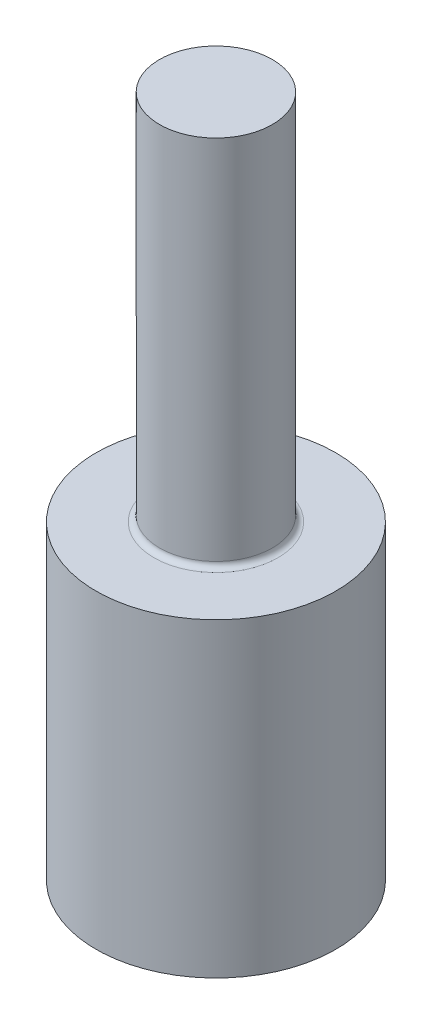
ISO-10303-21;
HEADER;
FILE_DESCRIPTION(('STEP AP214'),'2;1');
FILE_NAME('part.step','',(''),(''),'','','');
FILE_SCHEMA(('AUTOMOTIVE_DESIGN { 1 0 10303 214 1 1 1 1 }'));
ENDSEC;
DATA;
#1=APPLICATION_CONTEXT('core data for automotive mechanical design processes');
#2=APPLICATION_PROTOCOL_DEFINITION('international standard','automotive_design',2000,#1);
#3=PRODUCT_CONTEXT('',#1,'mechanical');
#4=PRODUCT('Part','Part','',(#3));
#5=PRODUCT_RELATED_PRODUCT_CATEGORY('part','',(#4));
#6=PRODUCT_DEFINITION_FORMATION('','',#4);
#7=PRODUCT_DEFINITION_CONTEXT('part definition',#1,'design');
#8=PRODUCT_DEFINITION('design','',#6,#7);
#9=PRODUCT_DEFINITION_SHAPE('','',#8);
#10=(LENGTH_UNIT() NAMED_UNIT(*) SI_UNIT(.MILLI.,.METRE.));
#11=(NAMED_UNIT(*) PLANE_ANGLE_UNIT() SI_UNIT($,.RADIAN.));
#12=(NAMED_UNIT(*) SI_UNIT($,.STERADIAN.) SOLID_ANGLE_UNIT());
#13=UNCERTAINTY_MEASURE_WITH_UNIT(LENGTH_MEASURE(1.E-05),#10,'distance_accuracy_value','');
#14=(GEOMETRIC_REPRESENTATION_CONTEXT(3) GLOBAL_UNCERTAINTY_ASSIGNED_CONTEXT((#13)) GLOBAL_UNIT_ASSIGNED_CONTEXT((#10,
#11,#12)) REPRESENTATION_CONTEXT('',''));
#15=CARTESIAN_POINT('',(0.,0.,0.));
#16=DIRECTION('',(0.,0.,1.));
#17=DIRECTION('',(1.,0.,0.));
#18=AXIS2_PLACEMENT_3D('',#15,#16,#17);
#19=CARTESIAN_POINT('',(0.,-6.000425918,0.));
#20=DIRECTION('',(0.,-1.,0.));
#21=DIRECTION('',(0.,0.,-1.));
#22=AXIS2_PLACEMENT_3D('',#19,#20,#21);
#23=CYLINDRICAL_SURFACE('',#22,2.);
#24=CARTESIAN_POINT('',(0.,5.199574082,0.));
#25=DIRECTION('',(0.,1.,0.));
#26=DIRECTION('',(0.,0.,1.));
#27=AXIS2_PLACEMENT_3D('',#24,#25,#26);
#28=CIRCLE('',#27,2.);
#29=CARTESIAN_POINT('',(0.,5.199574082,2.));
#30=VERTEX_POINT('',#29);
#31=EDGE_CURVE('E10',#30,#30,#28,.T.);
#32=ORIENTED_EDGE('',*,*,#31,.T.);
#33=EDGE_LOOP('',(#32));
#34=FACE_BOUND('',#33,.T.);
#35=CARTESIAN_POINT('',(0.,18.199574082,0.));
#36=DIRECTION('',(0.,-1.,0.));
#37=DIRECTION('',(0.,0.,-1.));
#38=AXIS2_PLACEMENT_3D('',#35,#36,#37);
#39=CIRCLE('',#38,2.);
#40=CARTESIAN_POINT('',(0.,18.199574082,-2.));
#41=VERTEX_POINT('',#40);
#42=EDGE_CURVE('E25',#41,#41,#39,.T.);
#43=ORIENTED_EDGE('',*,*,#42,.T.);
#44=EDGE_LOOP('',(#43));
#45=FACE_BOUND('',#44,.T.);
#46=ADVANCED_FACE('F14',(#34,#45),#23,.T.);
#47=CARTESIAN_POINT('',(4.25,4.999574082,0.));
#48=DIRECTION('',(0.,1.,0.));
#49=DIRECTION('',(0.,0.,1.));
#50=AXIS2_PLACEMENT_3D('',#47,#48,#49);
#51=PLANE('',#50);
#52=CARTESIAN_POINT('',(0.,4.999574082,0.));
#53=DIRECTION('',(0.,1.,0.));
#54=DIRECTION('',(0.,0.,1.));
#55=AXIS2_PLACEMENT_3D('',#52,#53,#54);
#56=CIRCLE('',#55,2.2);
#57=CARTESIAN_POINT('',(0.,4.999574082,2.2));
#58=VERTEX_POINT('',#57);
#59=EDGE_CURVE('E21',#58,#58,#56,.F.);
#60=ORIENTED_EDGE('',*,*,#59,.T.);
#61=EDGE_LOOP('',(#60));
#62=FACE_BOUND('',#61,.T.);
#63=CARTESIAN_POINT('',(0.,4.999574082,0.));
#64=DIRECTION('',(0.,-1.,0.));
#65=DIRECTION('',(0.,0.,-1.));
#66=AXIS2_PLACEMENT_3D('',#63,#64,#65);
#67=CIRCLE('',#66,4.25);
#68=CARTESIAN_POINT('',(0.,4.999574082,-4.25));
#69=VERTEX_POINT('',#68);
#70=EDGE_CURVE('E29',#69,#69,#67,.T.);
#71=ORIENTED_EDGE('',*,*,#70,.F.);
#72=EDGE_LOOP('',(#71));
#73=FACE_BOUND('',#72,.T.);
#74=ADVANCED_FACE('F54',(#62,#73),#51,.T.);
#75=CARTESIAN_POINT('',(0.,5.199574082,0.));
#76=DIRECTION('',(0.,1.,0.));
#77=DIRECTION('',(0.,0.,1.));
#78=AXIS2_PLACEMENT_3D('',#75,#76,#77);
#79=TOROIDAL_SURFACE('',#78,2.2,0.2);
#80=ORIENTED_EDGE('',*,*,#31,.F.);
#81=EDGE_LOOP('',(#80));
#82=FACE_BOUND('',#81,.T.);
#83=ORIENTED_EDGE('',*,*,#59,.F.);
#84=EDGE_LOOP('',(#83));
#85=FACE_BOUND('',#84,.T.);
#86=ADVANCED_FACE('F16',(#82,#85),#79,.F.);
#87=CARTESIAN_POINT('',(0.,18.199574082,0.));
#88=DIRECTION('',(0.,1.,0.));
#89=DIRECTION('',(0.,0.,1.));
#90=AXIS2_PLACEMENT_3D('',#87,#88,#89);
#91=PLANE('',#90);
#92=ORIENTED_EDGE('',*,*,#42,.F.);
#93=EDGE_LOOP('',(#92));
#94=FACE_BOUND('',#93,.T.);
#95=ADVANCED_FACE('F42',(#94),#91,.T.);
#96=CARTESIAN_POINT('',(0.,-6.000425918,0.));
#97=DIRECTION('',(0.,-1.,0.));
#98=DIRECTION('',(0.,0.,-1.));
#99=AXIS2_PLACEMENT_3D('',#96,#97,#98);
#100=CYLINDRICAL_SURFACE('',#99,4.25);
#101=ORIENTED_EDGE('',*,*,#70,.T.);
#102=EDGE_LOOP('',(#101));
#103=FACE_BOUND('',#102,.T.);
#104=CARTESIAN_POINT('',(0.,-6.000425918,0.));
#105=DIRECTION('',(0.,-1.,0.));
#106=DIRECTION('',(0.,0.,-1.));
#107=AXIS2_PLACEMENT_3D('',#104,#105,#106);
#108=CIRCLE('',#107,4.25);
#109=CARTESIAN_POINT('',(0.,-6.000425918,-4.25));
#110=VERTEX_POINT('',#109);
#111=EDGE_CURVE('E34',#110,#110,#108,.T.);
#112=ORIENTED_EDGE('',*,*,#111,.F.);
#113=EDGE_LOOP('',(#112));
#114=FACE_BOUND('',#113,.T.);
#115=ADVANCED_FACE('F40',(#103,#114),#100,.T.);
#116=CARTESIAN_POINT('',(0.,-6.000425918,0.));
#117=DIRECTION('',(0.,-1.,0.));
#118=DIRECTION('',(0.,0.,-1.));
#119=AXIS2_PLACEMENT_3D('',#116,#117,#118);
#120=PLANE('',#119);
#121=ORIENTED_EDGE('',*,*,#111,.T.);
#122=EDGE_LOOP('',(#121));
#123=FACE_BOUND('',#122,.T.);
#124=ADVANCED_FACE('F38',(#123),#120,.T.);
#125=CLOSED_SHELL('',(#46,#74,#86,#95,#115,#124));
#126=MANIFOLD_SOLID_BREP('B1',#125);
#127=ADVANCED_BREP_SHAPE_REPRESENTATION('',(#18,#126),#14);
#128=SHAPE_DEFINITION_REPRESENTATION(#9,#127);
ENDSEC;
END-ISO-10303-21;
